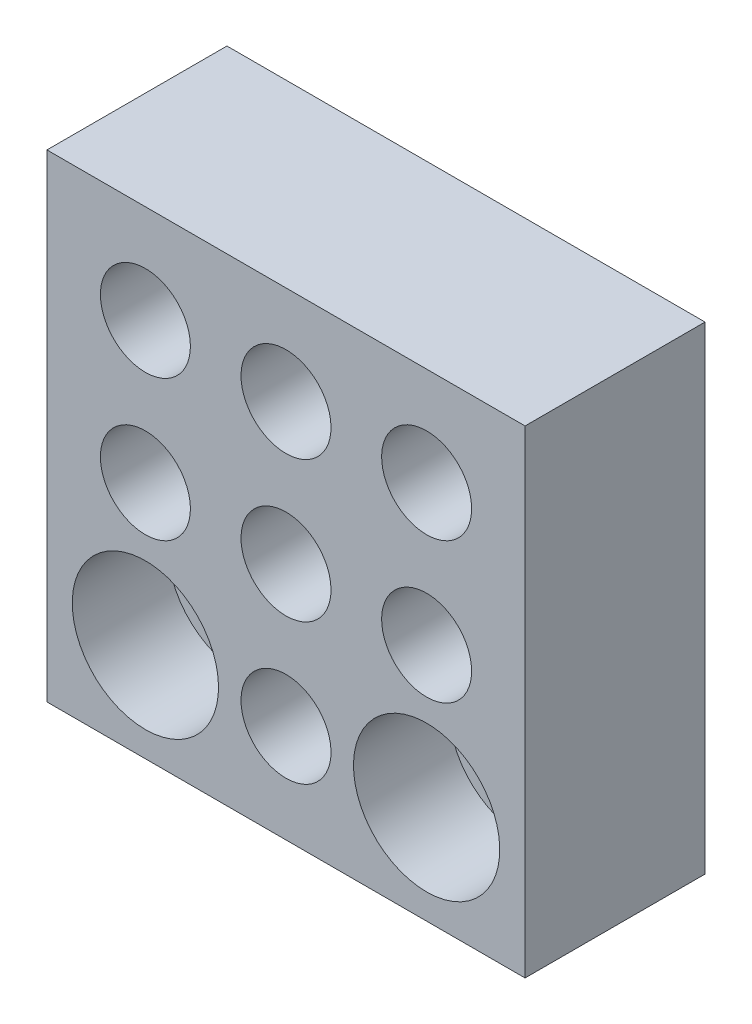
ISO-10303-21;
HEADER;
FILE_DESCRIPTION(('STEP AP214'),'2;1');
FILE_NAME('part.step','',(''),(''),'','','');
FILE_SCHEMA(('AUTOMOTIVE_DESIGN { 1 0 10303 214 1 1 1 1 }'));
ENDSEC;
DATA;
#1=APPLICATION_CONTEXT('core data for automotive mechanical design processes');
#2=APPLICATION_PROTOCOL_DEFINITION('international standard','automotive_design',2000,#1);
#3=PRODUCT_CONTEXT('',#1,'mechanical');
#4=PRODUCT('Part','Part','',(#3));
#5=PRODUCT_RELATED_PRODUCT_CATEGORY('part','',(#4));
#6=PRODUCT_DEFINITION_FORMATION('','',#4);
#7=PRODUCT_DEFINITION_CONTEXT('part definition',#1,'design');
#8=PRODUCT_DEFINITION('design','',#6,#7);
#9=PRODUCT_DEFINITION_SHAPE('','',#8);
#10=(LENGTH_UNIT() NAMED_UNIT(*) SI_UNIT(.MILLI.,.METRE.));
#11=(NAMED_UNIT(*) PLANE_ANGLE_UNIT() SI_UNIT($,.RADIAN.));
#12=(NAMED_UNIT(*) SI_UNIT($,.STERADIAN.) SOLID_ANGLE_UNIT());
#13=UNCERTAINTY_MEASURE_WITH_UNIT(LENGTH_MEASURE(1.E-05),#10,'distance_accuracy_value','');
#14=(GEOMETRIC_REPRESENTATION_CONTEXT(3) GLOBAL_UNCERTAINTY_ASSIGNED_CONTEXT((#13)) GLOBAL_UNIT_ASSIGNED_CONTEXT((#10,
#11,#12)) REPRESENTATION_CONTEXT('',''));
#15=CARTESIAN_POINT('',(0.,0.,0.));
#16=DIRECTION('',(0.,0.,1.));
#17=DIRECTION('',(1.,0.,0.));
#18=AXIS2_PLACEMENT_3D('',#15,#16,#17);
#19=CARTESIAN_POINT('',(-17.5,-17.5,32.));
#20=DIRECTION('',(0.,0.,-1.));
#21=DIRECTION('',(0.,1.,0.));
#22=AXIS2_PLACEMENT_3D('',#19,#20,#21);
#23=PLANE('',#22);
#24=CARTESIAN_POINT('',(50.,0.,32.));
#25=DIRECTION('',(0.,0.,1.));
#26=DIRECTION('',(0.,-1.,0.));
#27=AXIS2_PLACEMENT_3D('',#24,#25,#26);
#28=CIRCLE('',#27,13.);
#29=CARTESIAN_POINT('',(50.,-13.,32.));
#30=VERTEX_POINT('',#29);
#31=EDGE_CURVE('E132',#30,#30,#28,.T.);
#32=ORIENTED_EDGE('',*,*,#31,.F.);
#33=EDGE_LOOP('',(#32));
#34=FACE_BOUND('',#33,.T.);
#35=CARTESIAN_POINT('',(50.,50.,32.));
#36=DIRECTION('',(0.,0.,1.));
#37=DIRECTION('',(0.,-1.,0.));
#38=AXIS2_PLACEMENT_3D('',#35,#36,#37);
#39=CIRCLE('',#38,8.);
#40=CARTESIAN_POINT('',(50.,42.,32.));
#41=VERTEX_POINT('',#40);
#42=EDGE_CURVE('E120',#41,#41,#39,.T.);
#43=ORIENTED_EDGE('',*,*,#42,.F.);
#44=EDGE_LOOP('',(#43));
#45=FACE_BOUND('',#44,.T.);
#46=CARTESIAN_POINT('',(25.,50.,32.));
#47=DIRECTION('',(0.,0.,1.));
#48=DIRECTION('',(0.,-1.,0.));
#49=AXIS2_PLACEMENT_3D('',#46,#47,#48);
#50=CIRCLE('',#49,8.);
#51=CARTESIAN_POINT('',(25.,42.,32.));
#52=VERTEX_POINT('',#51);
#53=EDGE_CURVE('E108',#52,#52,#50,.T.);
#54=ORIENTED_EDGE('',*,*,#53,.F.);
#55=EDGE_LOOP('',(#54));
#56=FACE_BOUND('',#55,.T.);
#57=CARTESIAN_POINT('',(0.,25.,32.));
#58=DIRECTION('',(0.,0.,1.));
#59=DIRECTION('',(0.,-1.,0.));
#60=AXIS2_PLACEMENT_3D('',#57,#58,#59);
#61=CIRCLE('',#60,8.);
#62=CARTESIAN_POINT('',(0.,17.,32.));
#63=VERTEX_POINT('',#62);
#64=EDGE_CURVE('E96',#63,#63,#61,.T.);
#65=ORIENTED_EDGE('',*,*,#64,.F.);
#66=EDGE_LOOP('',(#65));
#67=FACE_BOUND('',#66,.T.);
#68=DIRECTION('',(-1.,0.,0.));
#69=VECTOR('',#68,1.);
#70=CARTESIAN_POINT('',(67.5,-17.5,32.));
#71=LINE('',#70,#69);
#72=CARTESIAN_POINT('',(67.5,-17.5,32.));
#73=VERTEX_POINT('',#72);
#74=CARTESIAN_POINT('',(-17.5,-17.5,32.));
#75=VERTEX_POINT('',#74);
#76=EDGE_CURVE('E56',#73,#75,#71,.T.);
#77=ORIENTED_EDGE('',*,*,#76,.F.);
#78=DIRECTION('',(0.,-1.,0.));
#79=VECTOR('',#78,1.);
#80=CARTESIAN_POINT('',(67.5,67.5,32.));
#81=LINE('',#80,#79);
#82=CARTESIAN_POINT('',(67.5,67.5,32.));
#83=VERTEX_POINT('',#82);
#84=EDGE_CURVE('E62',#83,#73,#81,.T.);
#85=ORIENTED_EDGE('',*,*,#84,.F.);
#86=DIRECTION('',(1.,0.,0.));
#87=VECTOR('',#86,1.);
#88=CARTESIAN_POINT('',(-17.5,67.5,32.));
#89=LINE('',#88,#87);
#90=CARTESIAN_POINT('',(-17.5,67.5,32.));
#91=VERTEX_POINT('',#90);
#92=EDGE_CURVE('E81',#91,#83,#89,.T.);
#93=ORIENTED_EDGE('',*,*,#92,.F.);
#94=DIRECTION('',(0.,1.,0.));
#95=VECTOR('',#94,1.);
#96=CARTESIAN_POINT('',(-17.5,-17.5,32.));
#97=LINE('',#96,#95);
#98=EDGE_CURVE('E83',#75,#91,#97,.T.);
#99=ORIENTED_EDGE('',*,*,#98,.F.);
#100=EDGE_LOOP('',(#77,#85,#93,#99));
#101=FACE_BOUND('',#100,.T.);
#102=CARTESIAN_POINT('',(25.,0.,32.));
#103=DIRECTION('',(0.,0.,1.));
#104=DIRECTION('',(0.,-1.,0.));
#105=AXIS2_PLACEMENT_3D('',#102,#103,#104);
#106=CIRCLE('',#105,8.);
#107=CARTESIAN_POINT('',(25.,-8.,32.));
#108=VERTEX_POINT('',#107);
#109=EDGE_CURVE('E72',#108,#108,#106,.T.);
#110=ORIENTED_EDGE('',*,*,#109,.F.);
#111=EDGE_LOOP('',(#110));
#112=FACE_BOUND('',#111,.T.);
#113=CARTESIAN_POINT('',(0.,50.,32.));
#114=DIRECTION('',(0.,0.,1.));
#115=DIRECTION('',(0.,-1.,0.));
#116=AXIS2_PLACEMENT_3D('',#113,#114,#115);
#117=CIRCLE('',#116,8.);
#118=CARTESIAN_POINT('',(0.,42.,32.));
#119=VERTEX_POINT('',#118);
#120=EDGE_CURVE('E102',#119,#119,#117,.T.);
#121=ORIENTED_EDGE('',*,*,#120,.F.);
#122=EDGE_LOOP('',(#121));
#123=FACE_BOUND('',#122,.T.);
#124=CARTESIAN_POINT('',(25.,25.,32.));
#125=DIRECTION('',(0.,0.,1.));
#126=DIRECTION('',(0.,-1.,0.));
#127=AXIS2_PLACEMENT_3D('',#124,#125,#126);
#128=CIRCLE('',#127,8.);
#129=CARTESIAN_POINT('',(25.,17.,32.));
#130=VERTEX_POINT('',#129);
#131=EDGE_CURVE('E114',#130,#130,#128,.T.);
#132=ORIENTED_EDGE('',*,*,#131,.F.);
#133=EDGE_LOOP('',(#132));
#134=FACE_BOUND('',#133,.T.);
#135=CARTESIAN_POINT('',(50.,25.,32.));
#136=DIRECTION('',(0.,0.,1.));
#137=DIRECTION('',(0.,-1.,0.));
#138=AXIS2_PLACEMENT_3D('',#135,#136,#137);
#139=CIRCLE('',#138,8.);
#140=CARTESIAN_POINT('',(50.,17.,32.));
#141=VERTEX_POINT('',#140);
#142=EDGE_CURVE('E126',#141,#141,#139,.T.);
#143=ORIENTED_EDGE('',*,*,#142,.F.);
#144=EDGE_LOOP('',(#143));
#145=FACE_BOUND('',#144,.T.);
#146=CARTESIAN_POINT('',(0.,0.,32.));
#147=DIRECTION('',(0.,0.,1.));
#148=DIRECTION('',(0.,-1.,0.));
#149=AXIS2_PLACEMENT_3D('',#146,#147,#148);
#150=CIRCLE('',#149,13.);
#151=CARTESIAN_POINT('',(0.,-13.,32.));
#152=VERTEX_POINT('',#151);
#153=EDGE_CURVE('E144',#152,#152,#150,.T.);
#154=ORIENTED_EDGE('',*,*,#153,.F.);
#155=EDGE_LOOP('',(#154));
#156=FACE_BOUND('',#155,.T.);
#157=ADVANCED_FACE('F14',(#34,#45,#56,#67,#101,#112,#123,#134,#145,#156),#23,.F.);
#158=CARTESIAN_POINT('',(-17.5,-17.5,0.));
#159=DIRECTION('',(0.,0.,-1.));
#160=DIRECTION('',(0.,1.,0.));
#161=AXIS2_PLACEMENT_3D('',#158,#159,#160);
#162=PLANE('',#161);
#163=CARTESIAN_POINT('',(50.,0.,0.));
#164=DIRECTION('',(0.,0.,1.));
#165=DIRECTION('',(0.,-1.,0.));
#166=AXIS2_PLACEMENT_3D('',#163,#164,#165);
#167=CIRCLE('',#166,9.);
#168=CARTESIAN_POINT('',(50.,-9.,0.));
#169=VERTEX_POINT('',#168);
#170=EDGE_CURVE('E141',#169,#169,#167,.T.);
#171=ORIENTED_EDGE('',*,*,#170,.T.);
#172=EDGE_LOOP('',(#171));
#173=FACE_BOUND('',#172,.T.);
#174=CARTESIAN_POINT('',(50.,50.,0.));
#175=DIRECTION('',(0.,0.,1.));
#176=DIRECTION('',(0.,-1.,0.));
#177=AXIS2_PLACEMENT_3D('',#174,#175,#176);
#178=CIRCLE('',#177,8.);
#179=CARTESIAN_POINT('',(50.,42.,0.));
#180=VERTEX_POINT('',#179);
#181=EDGE_CURVE('E123',#180,#180,#178,.T.);
#182=ORIENTED_EDGE('',*,*,#181,.T.);
#183=EDGE_LOOP('',(#182));
#184=FACE_BOUND('',#183,.T.);
#185=CARTESIAN_POINT('',(25.,50.,0.));
#186=DIRECTION('',(0.,0.,1.));
#187=DIRECTION('',(0.,-1.,0.));
#188=AXIS2_PLACEMENT_3D('',#185,#186,#187);
#189=CIRCLE('',#188,8.);
#190=CARTESIAN_POINT('',(25.,42.,0.));
#191=VERTEX_POINT('',#190);
#192=EDGE_CURVE('E111',#191,#191,#189,.T.);
#193=ORIENTED_EDGE('',*,*,#192,.T.);
#194=EDGE_LOOP('',(#193));
#195=FACE_BOUND('',#194,.T.);
#196=CARTESIAN_POINT('',(0.,25.,0.));
#197=DIRECTION('',(0.,0.,1.));
#198=DIRECTION('',(0.,-1.,0.));
#199=AXIS2_PLACEMENT_3D('',#196,#197,#198);
#200=CIRCLE('',#199,8.);
#201=CARTESIAN_POINT('',(0.,17.,0.));
#202=VERTEX_POINT('',#201);
#203=EDGE_CURVE('E99',#202,#202,#200,.T.);
#204=ORIENTED_EDGE('',*,*,#203,.T.);
#205=EDGE_LOOP('',(#204));
#206=FACE_BOUND('',#205,.T.);
#207=DIRECTION('',(-1.,0.,0.));
#208=VECTOR('',#207,1.);
#209=CARTESIAN_POINT('',(67.5,-17.5,0.));
#210=LINE('',#209,#208);
#211=CARTESIAN_POINT('',(67.5,-17.5,0.));
#212=VERTEX_POINT('',#211);
#213=CARTESIAN_POINT('',(-17.5,-17.5,0.));
#214=VERTEX_POINT('',#213);
#215=EDGE_CURVE('E54',#212,#214,#210,.T.);
#216=ORIENTED_EDGE('',*,*,#215,.T.);
#217=DIRECTION('',(0.,1.,0.));
#218=VECTOR('',#217,1.);
#219=CARTESIAN_POINT('',(-17.5,-17.5,0.));
#220=LINE('',#219,#218);
#221=CARTESIAN_POINT('',(-17.5,67.5,0.));
#222=VERTEX_POINT('',#221);
#223=EDGE_CURVE('E69',#214,#222,#220,.T.);
#224=ORIENTED_EDGE('',*,*,#223,.T.);
#225=DIRECTION('',(1.,0.,0.));
#226=VECTOR('',#225,1.);
#227=CARTESIAN_POINT('',(-17.5,67.5,0.));
#228=LINE('',#227,#226);
#229=CARTESIAN_POINT('',(67.5,67.5,0.));
#230=VERTEX_POINT('',#229);
#231=EDGE_CURVE('E75',#222,#230,#228,.T.);
#232=ORIENTED_EDGE('',*,*,#231,.T.);
#233=DIRECTION('',(0.,-1.,0.));
#234=VECTOR('',#233,1.);
#235=CARTESIAN_POINT('',(67.5,67.5,0.));
#236=LINE('',#235,#234);
#237=EDGE_CURVE('E71',#230,#212,#236,.T.);
#238=ORIENTED_EDGE('',*,*,#237,.T.);
#239=EDGE_LOOP('',(#216,#224,#232,#238));
#240=FACE_BOUND('',#239,.T.);
#241=CARTESIAN_POINT('',(25.,0.,0.));
#242=DIRECTION('',(0.,0.,1.));
#243=DIRECTION('',(0.,-1.,0.));
#244=AXIS2_PLACEMENT_3D('',#241,#242,#243);
#245=CIRCLE('',#244,8.);
#246=CARTESIAN_POINT('',(25.,-8.,0.));
#247=VERTEX_POINT('',#246);
#248=EDGE_CURVE('E93',#247,#247,#245,.T.);
#249=ORIENTED_EDGE('',*,*,#248,.T.);
#250=EDGE_LOOP('',(#249));
#251=FACE_BOUND('',#250,.T.);
#252=CARTESIAN_POINT('',(0.,50.,0.));
#253=DIRECTION('',(0.,0.,1.));
#254=DIRECTION('',(0.,-1.,0.));
#255=AXIS2_PLACEMENT_3D('',#252,#253,#254);
#256=CIRCLE('',#255,8.);
#257=CARTESIAN_POINT('',(0.,42.,0.));
#258=VERTEX_POINT('',#257);
#259=EDGE_CURVE('E105',#258,#258,#256,.T.);
#260=ORIENTED_EDGE('',*,*,#259,.T.);
#261=EDGE_LOOP('',(#260));
#262=FACE_BOUND('',#261,.T.);
#263=CARTESIAN_POINT('',(25.,25.,0.));
#264=DIRECTION('',(0.,0.,1.));
#265=DIRECTION('',(0.,-1.,0.));
#266=AXIS2_PLACEMENT_3D('',#263,#264,#265);
#267=CIRCLE('',#266,8.);
#268=CARTESIAN_POINT('',(25.,17.,0.));
#269=VERTEX_POINT('',#268);
#270=EDGE_CURVE('E117',#269,#269,#267,.T.);
#271=ORIENTED_EDGE('',*,*,#270,.T.);
#272=EDGE_LOOP('',(#271));
#273=FACE_BOUND('',#272,.T.);
#274=CARTESIAN_POINT('',(50.,25.,0.));
#275=DIRECTION('',(0.,0.,1.));
#276=DIRECTION('',(0.,-1.,0.));
#277=AXIS2_PLACEMENT_3D('',#274,#275,#276);
#278=CIRCLE('',#277,8.);
#279=CARTESIAN_POINT('',(50.,17.,0.));
#280=VERTEX_POINT('',#279);
#281=EDGE_CURVE('E129',#280,#280,#278,.T.);
#282=ORIENTED_EDGE('',*,*,#281,.T.);
#283=EDGE_LOOP('',(#282));
#284=FACE_BOUND('',#283,.T.);
#285=CARTESIAN_POINT('',(0.,0.,0.));
#286=DIRECTION('',(0.,0.,1.));
#287=DIRECTION('',(0.,-1.,0.));
#288=AXIS2_PLACEMENT_3D('',#285,#286,#287);
#289=CIRCLE('',#288,9.);
#290=CARTESIAN_POINT('',(0.,-9.,0.));
#291=VERTEX_POINT('',#290);
#292=EDGE_CURVE('E153',#291,#291,#289,.T.);
#293=ORIENTED_EDGE('',*,*,#292,.T.);
#294=EDGE_LOOP('',(#293));
#295=FACE_BOUND('',#294,.T.);
#296=ADVANCED_FACE('F66',(#173,#184,#195,#206,#240,#251,#262,#273,#284,#295),#162,.T.);
#297=CARTESIAN_POINT('',(67.5,-17.5,32.));
#298=DIRECTION('',(0.,-1.,0.));
#299=DIRECTION('',(1.,0.,0.));
#300=AXIS2_PLACEMENT_3D('',#297,#298,#299);
#301=PLANE('',#300);
#302=DIRECTION('',(0.,0.,-1.));
#303=VECTOR('',#302,1.);
#304=CARTESIAN_POINT('',(67.5,-17.5,32.));
#305=LINE('',#304,#303);
#306=EDGE_CURVE('E9',#73,#212,#305,.T.);
#307=ORIENTED_EDGE('',*,*,#306,.F.);
#308=ORIENTED_EDGE('',*,*,#76,.T.);
#309=DIRECTION('',(0.,0.,-1.));
#310=VECTOR('',#309,1.);
#311=CARTESIAN_POINT('',(-17.5,-17.5,32.));
#312=LINE('',#311,#310);
#313=EDGE_CURVE('E51',#75,#214,#312,.T.);
#314=ORIENTED_EDGE('',*,*,#313,.T.);
#315=ORIENTED_EDGE('',*,*,#215,.F.);
#316=EDGE_LOOP('',(#307,#308,#314,#315));
#317=FACE_BOUND('',#316,.T.);
#318=ADVANCED_FACE('F53',(#317),#301,.T.);
#319=CARTESIAN_POINT('',(67.5,67.5,32.));
#320=DIRECTION('',(1.,0.,0.));
#321=DIRECTION('',(0.,1.,0.));
#322=AXIS2_PLACEMENT_3D('',#319,#320,#321);
#323=PLANE('',#322);
#324=DIRECTION('',(0.,0.,-1.));
#325=VECTOR('',#324,1.);
#326=CARTESIAN_POINT('',(67.5,67.5,32.));
#327=LINE('',#326,#325);
#328=EDGE_CURVE('E22',#83,#230,#327,.T.);
#329=ORIENTED_EDGE('',*,*,#328,.F.);
#330=ORIENTED_EDGE('',*,*,#84,.T.);
#331=ORIENTED_EDGE('',*,*,#306,.T.);
#332=ORIENTED_EDGE('',*,*,#237,.F.);
#333=EDGE_LOOP('',(#329,#330,#331,#332));
#334=FACE_BOUND('',#333,.T.);
#335=ADVANCED_FACE('F16',(#334),#323,.T.);
#336=CARTESIAN_POINT('',(-17.5,67.5,32.));
#337=DIRECTION('',(0.,1.,0.));
#338=DIRECTION('',(-1.,0.,0.));
#339=AXIS2_PLACEMENT_3D('',#336,#337,#338);
#340=PLANE('',#339);
#341=DIRECTION('',(0.,0.,-1.));
#342=VECTOR('',#341,1.);
#343=CARTESIAN_POINT('',(-17.5,67.5,32.));
#344=LINE('',#343,#342);
#345=EDGE_CURVE('E61',#91,#222,#344,.T.);
#346=ORIENTED_EDGE('',*,*,#345,.F.);
#347=ORIENTED_EDGE('',*,*,#92,.T.);
#348=ORIENTED_EDGE('',*,*,#328,.T.);
#349=ORIENTED_EDGE('',*,*,#231,.F.);
#350=EDGE_LOOP('',(#346,#347,#348,#349));
#351=FACE_BOUND('',#350,.T.);
#352=ADVANCED_FACE('F87',(#351),#340,.T.);
#353=CARTESIAN_POINT('',(-17.5,-17.5,32.));
#354=DIRECTION('',(-1.,0.,0.));
#355=DIRECTION('',(0.,-1.,0.));
#356=AXIS2_PLACEMENT_3D('',#353,#354,#355);
#357=PLANE('',#356);
#358=ORIENTED_EDGE('',*,*,#98,.T.);
#359=ORIENTED_EDGE('',*,*,#345,.T.);
#360=ORIENTED_EDGE('',*,*,#223,.F.);
#361=ORIENTED_EDGE('',*,*,#313,.F.);
#362=EDGE_LOOP('',(#358,#359,#360,#361));
#363=FACE_BOUND('',#362,.T.);
#364=ADVANCED_FACE('F74',(#363),#357,.T.);
#365=CARTESIAN_POINT('',(25.,0.,32.));
#366=DIRECTION('',(0.,0.,-1.));
#367=DIRECTION('',(0.,1.,0.));
#368=AXIS2_PLACEMENT_3D('',#365,#366,#367);
#369=CYLINDRICAL_SURFACE('',#368,8.);
#370=ORIENTED_EDGE('',*,*,#109,.T.);
#371=EDGE_LOOP('',(#370));
#372=FACE_BOUND('',#371,.T.);
#373=ORIENTED_EDGE('',*,*,#248,.F.);
#374=EDGE_LOOP('',(#373));
#375=FACE_BOUND('',#374,.T.);
#376=ADVANCED_FACE('F185',(#372,#375),#369,.F.);
#377=CARTESIAN_POINT('',(0.,25.,32.));
#378=DIRECTION('',(0.,0.,-1.));
#379=DIRECTION('',(0.,1.,0.));
#380=AXIS2_PLACEMENT_3D('',#377,#378,#379);
#381=CYLINDRICAL_SURFACE('',#380,8.);
#382=ORIENTED_EDGE('',*,*,#64,.T.);
#383=EDGE_LOOP('',(#382));
#384=FACE_BOUND('',#383,.T.);
#385=ORIENTED_EDGE('',*,*,#203,.F.);
#386=EDGE_LOOP('',(#385));
#387=FACE_BOUND('',#386,.T.);
#388=ADVANCED_FACE('F313',(#384,#387),#381,.F.);
#389=CARTESIAN_POINT('',(0.,50.,32.));
#390=DIRECTION('',(0.,0.,-1.));
#391=DIRECTION('',(0.,1.,0.));
#392=AXIS2_PLACEMENT_3D('',#389,#390,#391);
#393=CYLINDRICAL_SURFACE('',#392,8.);
#394=ORIENTED_EDGE('',*,*,#120,.T.);
#395=EDGE_LOOP('',(#394));
#396=FACE_BOUND('',#395,.T.);
#397=ORIENTED_EDGE('',*,*,#259,.F.);
#398=EDGE_LOOP('',(#397));
#399=FACE_BOUND('',#398,.T.);
#400=ADVANCED_FACE('F303',(#396,#399),#393,.F.);
#401=CARTESIAN_POINT('',(25.,50.,32.));
#402=DIRECTION('',(0.,0.,-1.));
#403=DIRECTION('',(0.,1.,0.));
#404=AXIS2_PLACEMENT_3D('',#401,#402,#403);
#405=CYLINDRICAL_SURFACE('',#404,8.);
#406=ORIENTED_EDGE('',*,*,#53,.T.);
#407=EDGE_LOOP('',(#406));
#408=FACE_BOUND('',#407,.T.);
#409=ORIENTED_EDGE('',*,*,#192,.F.);
#410=EDGE_LOOP('',(#409));
#411=FACE_BOUND('',#410,.T.);
#412=ADVANCED_FACE('F293',(#408,#411),#405,.F.);
#413=CARTESIAN_POINT('',(25.,25.,32.));
#414=DIRECTION('',(0.,0.,-1.));
#415=DIRECTION('',(0.,1.,0.));
#416=AXIS2_PLACEMENT_3D('',#413,#414,#415);
#417=CYLINDRICAL_SURFACE('',#416,8.);
#418=ORIENTED_EDGE('',*,*,#131,.T.);
#419=EDGE_LOOP('',(#418));
#420=FACE_BOUND('',#419,.T.);
#421=ORIENTED_EDGE('',*,*,#270,.F.);
#422=EDGE_LOOP('',(#421));
#423=FACE_BOUND('',#422,.T.);
#424=ADVANCED_FACE('F283',(#420,#423),#417,.F.);
#425=CARTESIAN_POINT('',(50.,50.,32.));
#426=DIRECTION('',(0.,0.,-1.));
#427=DIRECTION('',(0.,1.,0.));
#428=AXIS2_PLACEMENT_3D('',#425,#426,#427);
#429=CYLINDRICAL_SURFACE('',#428,8.);
#430=ORIENTED_EDGE('',*,*,#42,.T.);
#431=EDGE_LOOP('',(#430));
#432=FACE_BOUND('',#431,.T.);
#433=ORIENTED_EDGE('',*,*,#181,.F.);
#434=EDGE_LOOP('',(#433));
#435=FACE_BOUND('',#434,.T.);
#436=ADVANCED_FACE('F273',(#432,#435),#429,.F.);
#437=CARTESIAN_POINT('',(50.,25.,32.));
#438=DIRECTION('',(0.,0.,-1.));
#439=DIRECTION('',(0.,1.,0.));
#440=AXIS2_PLACEMENT_3D('',#437,#438,#439);
#441=CYLINDRICAL_SURFACE('',#440,8.);
#442=ORIENTED_EDGE('',*,*,#142,.T.);
#443=EDGE_LOOP('',(#442));
#444=FACE_BOUND('',#443,.T.);
#445=ORIENTED_EDGE('',*,*,#281,.F.);
#446=EDGE_LOOP('',(#445));
#447=FACE_BOUND('',#446,.T.);
#448=ADVANCED_FACE('F263',(#444,#447),#441,.F.);
#449=CARTESIAN_POINT('',(50.,0.,32.));
#450=DIRECTION('',(0.,0.,1.));
#451=DIRECTION('',(0.,-1.,0.));
#452=AXIS2_PLACEMENT_3D('',#449,#450,#451);
#453=CYLINDRICAL_SURFACE('',#452,13.);
#454=ORIENTED_EDGE('',*,*,#31,.T.);
#455=EDGE_LOOP('',(#454));
#456=FACE_BOUND('',#455,.T.);
#457=CARTESIAN_POINT('',(50.,0.,15.));
#458=DIRECTION('',(0.,0.,1.));
#459=DIRECTION('',(0.,-1.,0.));
#460=AXIS2_PLACEMENT_3D('',#457,#458,#459);
#461=CIRCLE('',#460,13.);
#462=CARTESIAN_POINT('',(50.,-13.,15.));
#463=VERTEX_POINT('',#462);
#464=EDGE_CURVE('E135',#463,#463,#461,.T.);
#465=ORIENTED_EDGE('',*,*,#464,.F.);
#466=EDGE_LOOP('',(#465));
#467=FACE_BOUND('',#466,.T.);
#468=ADVANCED_FACE('F253',(#456,#467),#453,.F.);
#469=CARTESIAN_POINT('',(50.,-9.,15.));
#470=DIRECTION('',(0.,0.,1.));
#471=DIRECTION('',(0.,-1.,0.));
#472=AXIS2_PLACEMENT_3D('',#469,#470,#471);
#473=PLANE('',#472);
#474=ORIENTED_EDGE('',*,*,#464,.T.);
#475=EDGE_LOOP('',(#474));
#476=FACE_BOUND('',#475,.T.);
#477=CARTESIAN_POINT('',(50.,0.,15.));
#478=DIRECTION('',(0.,0.,1.));
#479=DIRECTION('',(0.,-1.,0.));
#480=AXIS2_PLACEMENT_3D('',#477,#478,#479);
#481=CIRCLE('',#480,9.);
#482=CARTESIAN_POINT('',(50.,-9.,15.));
#483=VERTEX_POINT('',#482);
#484=EDGE_CURVE('E138',#483,#483,#481,.T.);
#485=ORIENTED_EDGE('',*,*,#484,.F.);
#486=EDGE_LOOP('',(#485));
#487=FACE_BOUND('',#486,.T.);
#488=ADVANCED_FACE('F243',(#476,#487),#473,.T.);
#489=CARTESIAN_POINT('',(50.,0.,32.));
#490=DIRECTION('',(0.,0.,1.));
#491=DIRECTION('',(0.,-1.,0.));
#492=AXIS2_PLACEMENT_3D('',#489,#490,#491);
#493=CYLINDRICAL_SURFACE('',#492,9.);
#494=ORIENTED_EDGE('',*,*,#484,.T.);
#495=EDGE_LOOP('',(#494));
#496=FACE_BOUND('',#495,.T.);
#497=ORIENTED_EDGE('',*,*,#170,.F.);
#498=EDGE_LOOP('',(#497));
#499=FACE_BOUND('',#498,.T.);
#500=ADVANCED_FACE('F233',(#496,#499),#493,.F.);
#501=CARTESIAN_POINT('',(0.,0.,32.));
#502=DIRECTION('',(0.,0.,1.));
#503=DIRECTION('',(0.,-1.,0.));
#504=AXIS2_PLACEMENT_3D('',#501,#502,#503);
#505=CYLINDRICAL_SURFACE('',#504,13.);
#506=ORIENTED_EDGE('',*,*,#153,.T.);
#507=EDGE_LOOP('',(#506));
#508=FACE_BOUND('',#507,.T.);
#509=CARTESIAN_POINT('',(0.,0.,15.));
#510=DIRECTION('',(0.,0.,1.));
#511=DIRECTION('',(0.,-1.,0.));
#512=AXIS2_PLACEMENT_3D('',#509,#510,#511);
#513=CIRCLE('',#512,13.);
#514=CARTESIAN_POINT('',(0.,-13.,15.));
#515=VERTEX_POINT('',#514);
#516=EDGE_CURVE('E147',#515,#515,#513,.T.);
#517=ORIENTED_EDGE('',*,*,#516,.F.);
#518=EDGE_LOOP('',(#517));
#519=FACE_BOUND('',#518,.T.);
#520=ADVANCED_FACE('F167',(#508,#519),#505,.F.);
#521=CARTESIAN_POINT('',(0.,-9.,15.));
#522=DIRECTION('',(0.,0.,1.));
#523=DIRECTION('',(0.,-1.,0.));
#524=AXIS2_PLACEMENT_3D('',#521,#522,#523);
#525=PLANE('',#524);
#526=ORIENTED_EDGE('',*,*,#516,.T.);
#527=EDGE_LOOP('',(#526));
#528=FACE_BOUND('',#527,.T.);
#529=CARTESIAN_POINT('',(0.,0.,15.));
#530=DIRECTION('',(0.,0.,1.));
#531=DIRECTION('',(0.,-1.,0.));
#532=AXIS2_PLACEMENT_3D('',#529,#530,#531);
#533=CIRCLE('',#532,9.);
#534=CARTESIAN_POINT('',(0.,-9.,15.));
#535=VERTEX_POINT('',#534);
#536=EDGE_CURVE('E150',#535,#535,#533,.T.);
#537=ORIENTED_EDGE('',*,*,#536,.F.);
#538=EDGE_LOOP('',(#537));
#539=FACE_BOUND('',#538,.T.);
#540=ADVANCED_FACE('F160',(#528,#539),#525,.T.);
#541=CARTESIAN_POINT('',(0.,0.,32.));
#542=DIRECTION('',(0.,0.,1.));
#543=DIRECTION('',(0.,-1.,0.));
#544=AXIS2_PLACEMENT_3D('',#541,#542,#543);
#545=CYLINDRICAL_SURFACE('',#544,9.);
#546=ORIENTED_EDGE('',*,*,#536,.T.);
#547=EDGE_LOOP('',(#546));
#548=FACE_BOUND('',#547,.T.);
#549=ORIENTED_EDGE('',*,*,#292,.F.);
#550=EDGE_LOOP('',(#549));
#551=FACE_BOUND('',#550,.T.);
#552=ADVANCED_FACE('F158',(#548,#551),#545,.F.);
#553=CLOSED_SHELL('',(#157,#296,#318,#335,#352,#364,#376,#388,#400,#412,#424,#436,#448,#468,
#488,#500,#520,#540,#552));
#554=MANIFOLD_SOLID_BREP('B1',#553);
#555=ADVANCED_BREP_SHAPE_REPRESENTATION('',(#18,#554),#14);
#556=SHAPE_DEFINITION_REPRESENTATION(#9,#555);
ENDSEC;
END-ISO-10303-21;
